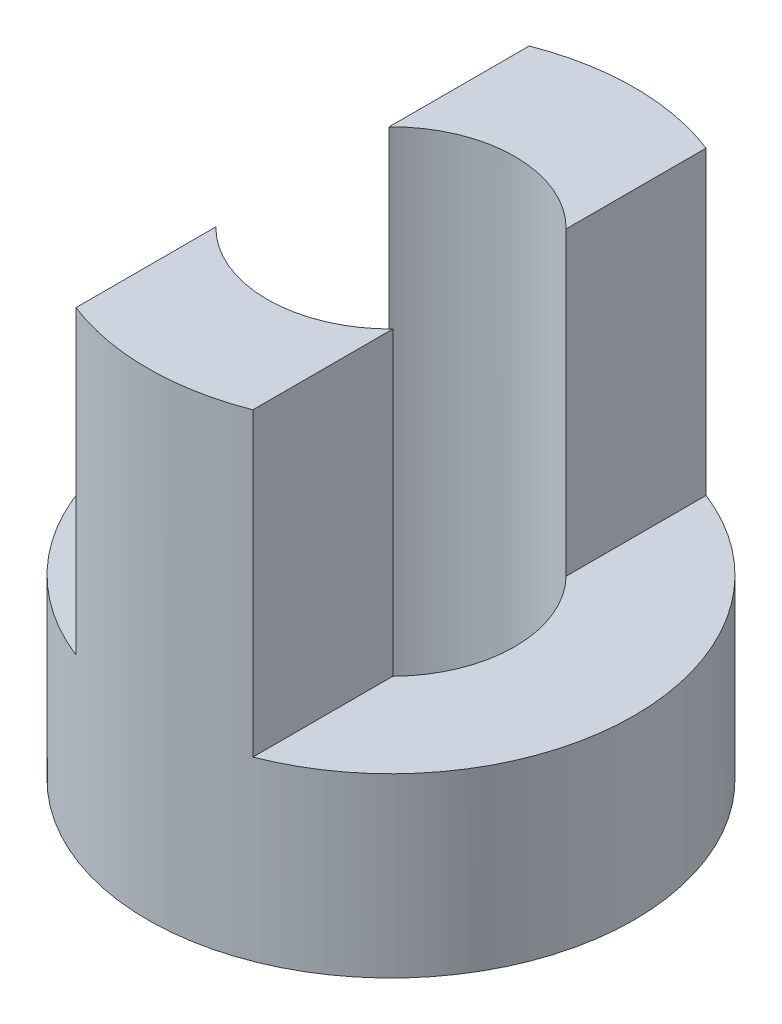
ISO-10303-21;
HEADER;
FILE_DESCRIPTION(('STEP AP214'),'2;1');
FILE_NAME('part.step','',(''),(''),'','','');
FILE_SCHEMA(('AUTOMOTIVE_DESIGN { 1 0 10303 214 1 1 1 1 }'));
ENDSEC;
DATA;
#1=APPLICATION_CONTEXT('core data for automotive mechanical design processes');
#2=APPLICATION_PROTOCOL_DEFINITION('international standard','automotive_design',2000,#1);
#3=PRODUCT_CONTEXT('',#1,'mechanical');
#4=PRODUCT('Part','Part','',(#3));
#5=PRODUCT_RELATED_PRODUCT_CATEGORY('part','',(#4));
#6=PRODUCT_DEFINITION_FORMATION('','',#4);
#7=PRODUCT_DEFINITION_CONTEXT('part definition',#1,'design');
#8=PRODUCT_DEFINITION('design','',#6,#7);
#9=PRODUCT_DEFINITION_SHAPE('','',#8);
#10=(LENGTH_UNIT() NAMED_UNIT(*) SI_UNIT(.MILLI.,.METRE.));
#11=(NAMED_UNIT(*) PLANE_ANGLE_UNIT() SI_UNIT($,.RADIAN.));
#12=(NAMED_UNIT(*) SI_UNIT($,.STERADIAN.) SOLID_ANGLE_UNIT());
#13=UNCERTAINTY_MEASURE_WITH_UNIT(LENGTH_MEASURE(1.E-05),#10,'distance_accuracy_value','');
#14=(GEOMETRIC_REPRESENTATION_CONTEXT(3) GLOBAL_UNCERTAINTY_ASSIGNED_CONTEXT((#13)) GLOBAL_UNIT_ASSIGNED_CONTEXT((#10,
#11,#12)) REPRESENTATION_CONTEXT('',''));
#15=CARTESIAN_POINT('',(0.,0.,0.));
#16=DIRECTION('',(0.,0.,1.));
#17=DIRECTION('',(1.,0.,0.));
#18=AXIS2_PLACEMENT_3D('',#15,#16,#17);
#19=CARTESIAN_POINT('',(0.,77.,0.));
#20=DIRECTION('',(0.,-1.,0.));
#21=DIRECTION('',(1.,0.,0.));
#22=AXIS2_PLACEMENT_3D('',#19,#20,#21);
#23=CYLINDRICAL_SURFACE('',#22,14.);
#24=DIRECTION('',(0.,1.,0.));
#25=VECTOR('',#24,1.);
#26=CARTESIAN_POINT('',(-10.,38.9993507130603,9.79795897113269));
#27=LINE('',#26,#25);
#28=CARTESIAN_POINT('',(-10.,19.9993507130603,9.7979589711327));
#29=VERTEX_POINT('',#28);
#30=CARTESIAN_POINT('',(-10.,53.9993507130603,9.7979589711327));
#31=VERTEX_POINT('',#30);
#32=EDGE_CURVE('E107',#29,#31,#27,.T.);
#33=ORIENTED_EDGE('',*,*,#32,.T.);
#34=CARTESIAN_POINT('',(0.,53.9993507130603,0.));
#35=DIRECTION('',(0.,-1.,0.));
#36=DIRECTION('',(1.,0.,0.));
#37=AXIS2_PLACEMENT_3D('',#34,#35,#36);
#38=CIRCLE('',#37,14.);
#39=CARTESIAN_POINT('',(10.,53.9993507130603,9.7979589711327));
#40=VERTEX_POINT('',#39);
#41=EDGE_CURVE('E108',#31,#40,#38,.F.);
#42=ORIENTED_EDGE('',*,*,#41,.T.);
#43=DIRECTION('',(0.,1.,0.));
#44=VECTOR('',#43,1.);
#45=CARTESIAN_POINT('',(10.,38.9993507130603,9.79795897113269));
#46=LINE('',#45,#44);
#47=CARTESIAN_POINT('',(10.,19.9993507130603,9.7979589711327));
#48=VERTEX_POINT('',#47);
#49=EDGE_CURVE('E110',#40,#48,#46,.F.);
#50=ORIENTED_EDGE('',*,*,#49,.T.);
#51=CARTESIAN_POINT('',(0.,19.9993507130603,0.));
#52=DIRECTION('',(0.,-1.,0.));
#53=DIRECTION('',(1.,0.,0.));
#54=AXIS2_PLACEMENT_3D('',#51,#52,#53);
#55=CIRCLE('',#54,14.);
#56=CARTESIAN_POINT('',(10.,19.9993507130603,-9.7979589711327));
#57=VERTEX_POINT('',#56);
#58=EDGE_CURVE('E135',#48,#57,#55,.F.);
#59=ORIENTED_EDGE('',*,*,#58,.T.);
#60=DIRECTION('',(0.,1.,0.));
#61=VECTOR('',#60,1.);
#62=CARTESIAN_POINT('',(10.,38.9993507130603,-9.79795897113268));
#63=LINE('',#62,#61);
#64=CARTESIAN_POINT('',(10.,53.9993507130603,-9.7979589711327));
#65=VERTEX_POINT('',#64);
#66=EDGE_CURVE('E115',#57,#65,#63,.T.);
#67=ORIENTED_EDGE('',*,*,#66,.T.);
#68=CARTESIAN_POINT('',(0.,53.9993507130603,0.));
#69=DIRECTION('',(0.,-1.,0.));
#70=DIRECTION('',(1.,0.,0.));
#71=AXIS2_PLACEMENT_3D('',#68,#69,#70);
#72=CIRCLE('',#71,14.);
#73=CARTESIAN_POINT('',(-10.,53.9993507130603,-9.7979589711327));
#74=VERTEX_POINT('',#73);
#75=EDGE_CURVE('E93',#65,#74,#72,.F.);
#76=ORIENTED_EDGE('',*,*,#75,.T.);
#77=DIRECTION('',(0.,1.,0.));
#78=VECTOR('',#77,1.);
#79=CARTESIAN_POINT('',(-10.,38.9993507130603,-9.79795897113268));
#80=LINE('',#79,#78);
#81=CARTESIAN_POINT('',(-10.,19.9993507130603,-9.7979589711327));
#82=VERTEX_POINT('',#81);
#83=EDGE_CURVE('E90',#74,#82,#80,.F.);
#84=ORIENTED_EDGE('',*,*,#83,.T.);
#85=CARTESIAN_POINT('',(0.,19.9993507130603,0.));
#86=DIRECTION('',(0.,-1.,0.));
#87=DIRECTION('',(1.,0.,0.));
#88=AXIS2_PLACEMENT_3D('',#85,#86,#87);
#89=CIRCLE('',#88,14.);
#90=EDGE_CURVE('E79',#82,#29,#89,.F.);
#91=ORIENTED_EDGE('',*,*,#90,.T.);
#92=EDGE_LOOP('',(#33,#42,#50,#59,#67,#76,#84,#91));
#93=FACE_BOUND('',#92,.T.);
#94=CARTESIAN_POINT('',(0.,0.,0.));
#95=DIRECTION('',(0.,-1.,0.));
#96=DIRECTION('',(1.,0.,0.));
#97=AXIS2_PLACEMENT_3D('',#94,#95,#96);
#98=CIRCLE('',#97,14.);
#99=CARTESIAN_POINT('',(14.,0.,0.));
#100=VERTEX_POINT('',#99);
#101=EDGE_CURVE('E19',#100,#100,#98,.F.);
#102=ORIENTED_EDGE('',*,*,#101,.F.);
#103=EDGE_LOOP('',(#102));
#104=FACE_BOUND('',#103,.T.);
#105=ADVANCED_FACE('F16',(#93,#104),#23,.F.);
#106=CARTESIAN_POINT('',(27.5,0.,0.));
#107=DIRECTION('',(0.,-1.,0.));
#108=DIRECTION('',(0.,0.,-1.));
#109=AXIS2_PLACEMENT_3D('',#106,#107,#108);
#110=PLANE('',#109);
#111=ORIENTED_EDGE('',*,*,#101,.T.);
#112=EDGE_LOOP('',(#111));
#113=FACE_BOUND('',#112,.T.);
#114=CARTESIAN_POINT('',(0.,0.,0.));
#115=DIRECTION('',(0.,-1.,0.));
#116=DIRECTION('',(1.,0.,0.));
#117=AXIS2_PLACEMENT_3D('',#114,#115,#116);
#118=CIRCLE('',#117,27.5);
#119=CARTESIAN_POINT('',(27.5,0.,0.));
#120=VERTEX_POINT('',#119);
#121=EDGE_CURVE('E130',#120,#120,#118,.F.);
#122=ORIENTED_EDGE('',*,*,#121,.F.);
#123=EDGE_LOOP('',(#122));
#124=FACE_BOUND('',#123,.T.);
#125=ADVANCED_FACE('F229',(#113,#124),#110,.T.);
#126=CARTESIAN_POINT('',(0.,19.9993507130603,0.));
#127=DIRECTION('',(0.,-1.,0.));
#128=DIRECTION('',(0.,0.,-1.));
#129=AXIS2_PLACEMENT_3D('',#126,#127,#128);
#130=PLANE('',#129);
#131=CARTESIAN_POINT('',(0.,19.9993507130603,0.));
#132=DIRECTION('',(0.,-1.,0.));
#133=DIRECTION('',(1.,0.,0.));
#134=AXIS2_PLACEMENT_3D('',#131,#132,#133);
#135=CIRCLE('',#134,27.5);
#136=CARTESIAN_POINT('',(-10.,19.9993507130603,25.617376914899));
#137=VERTEX_POINT('',#136);
#138=CARTESIAN_POINT('',(-10.,19.9993507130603,-25.617376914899));
#139=VERTEX_POINT('',#138);
#140=EDGE_CURVE('E128',#137,#139,#135,.T.);
#141=ORIENTED_EDGE('',*,*,#140,.F.);
#142=DIRECTION('',(0.,0.,-1.));
#143=VECTOR('',#142,1.);
#144=CARTESIAN_POINT('',(-10.,19.9993507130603,10.));
#145=LINE('',#144,#143);
#146=EDGE_CURVE('E86',#137,#29,#145,.T.);
#147=ORIENTED_EDGE('',*,*,#146,.T.);
#148=ORIENTED_EDGE('',*,*,#90,.F.);
#149=DIRECTION('',(0.,0.,-1.));
#150=VECTOR('',#149,1.);
#151=CARTESIAN_POINT('',(-10.,19.9993507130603,10.));
#152=LINE('',#151,#150);
#153=EDGE_CURVE('E83',#82,#139,#152,.T.);
#154=ORIENTED_EDGE('',*,*,#153,.T.);
#155=EDGE_LOOP('',(#141,#147,#148,#154));
#156=FACE_BOUND('',#155,.T.);
#157=ADVANCED_FACE('F81',(#156),#130,.F.);
#158=CARTESIAN_POINT('',(-10.,38.9993507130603,10.));
#159=DIRECTION('',(1.,0.,0.));
#160=DIRECTION('',(0.,0.,-1.));
#161=AXIS2_PLACEMENT_3D('',#158,#159,#160);
#162=PLANE('',#161);
#163=DIRECTION('',(0.,0.,-1.));
#164=VECTOR('',#163,1.);
#165=CARTESIAN_POINT('',(-10.,53.9993507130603,10.));
#166=LINE('',#165,#164);
#167=CARTESIAN_POINT('',(-10.,53.9993507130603,-25.617376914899));
#168=VERTEX_POINT('',#167);
#169=EDGE_CURVE('E96',#74,#168,#166,.T.);
#170=ORIENTED_EDGE('',*,*,#169,.T.);
#171=DIRECTION('',(0.,-1.,0.));
#172=VECTOR('',#171,1.);
#173=CARTESIAN_POINT('',(-10.,77.,-25.617376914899));
#174=LINE('',#173,#172);
#175=EDGE_CURVE('E100',#139,#168,#174,.F.);
#176=ORIENTED_EDGE('',*,*,#175,.F.);
#177=ORIENTED_EDGE('',*,*,#153,.F.);
#178=ORIENTED_EDGE('',*,*,#83,.F.);
#179=EDGE_LOOP('',(#170,#176,#177,#178));
#180=FACE_BOUND('',#179,.T.);
#181=ADVANCED_FACE('F98',(#180),#162,.F.);
#182=CARTESIAN_POINT('',(-5.,53.9993507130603,10.));
#183=DIRECTION('',(0.,-1.,0.));
#184=DIRECTION('',(0.,0.,-1.));
#185=AXIS2_PLACEMENT_3D('',#182,#183,#184);
#186=PLANE('',#185);
#187=DIRECTION('',(0.,0.,1.));
#188=VECTOR('',#187,1.);
#189=CARTESIAN_POINT('',(10.,53.9993507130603,10.));
#190=LINE('',#189,#188);
#191=CARTESIAN_POINT('',(10.,53.9993507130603,-25.617376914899));
#192=VERTEX_POINT('',#191);
#193=EDGE_CURVE('E116',#65,#192,#190,.F.);
#194=ORIENTED_EDGE('',*,*,#193,.T.);
#195=CARTESIAN_POINT('',(0.,53.9993507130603,0.));
#196=DIRECTION('',(0.,-1.,0.));
#197=DIRECTION('',(1.,0.,0.));
#198=AXIS2_PLACEMENT_3D('',#195,#196,#197);
#199=CIRCLE('',#198,27.5);
#200=EDGE_CURVE('E125',#168,#192,#199,.T.);
#201=ORIENTED_EDGE('',*,*,#200,.F.);
#202=ORIENTED_EDGE('',*,*,#169,.F.);
#203=ORIENTED_EDGE('',*,*,#75,.F.);
#204=EDGE_LOOP('',(#194,#201,#202,#203));
#205=FACE_BOUND('',#204,.T.);
#206=ADVANCED_FACE('F166',(#205),#186,.F.);
#207=CARTESIAN_POINT('',(10.,38.9993507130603,10.));
#208=DIRECTION('',(-1.,0.,0.));
#209=DIRECTION('',(0.,0.,1.));
#210=AXIS2_PLACEMENT_3D('',#207,#208,#209);
#211=PLANE('',#210);
#212=ORIENTED_EDGE('',*,*,#193,.F.);
#213=ORIENTED_EDGE('',*,*,#66,.F.);
#214=DIRECTION('',(0.,0.,-1.));
#215=VECTOR('',#214,1.);
#216=CARTESIAN_POINT('',(10.,19.9993507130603,0.));
#217=LINE('',#216,#215);
#218=CARTESIAN_POINT('',(9.99999999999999,19.9993507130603,-25.617376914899));
#219=VERTEX_POINT('',#218);
#220=EDGE_CURVE('E137',#57,#219,#217,.T.);
#221=ORIENTED_EDGE('',*,*,#220,.T.);
#222=DIRECTION('',(0.,-1.,0.));
#223=VECTOR('',#222,1.);
#224=CARTESIAN_POINT('',(9.99999999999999,77.,-25.617376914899));
#225=LINE('',#224,#223);
#226=EDGE_CURVE('E124',#192,#219,#225,.T.);
#227=ORIENTED_EDGE('',*,*,#226,.F.);
#228=EDGE_LOOP('',(#212,#213,#221,#227));
#229=FACE_BOUND('',#228,.T.);
#230=ADVANCED_FACE('F169',(#229),#211,.F.);
#231=CARTESIAN_POINT('',(0.,19.9993507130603,0.));
#232=DIRECTION('',(0.,-1.,0.));
#233=DIRECTION('',(0.,0.,-1.));
#234=AXIS2_PLACEMENT_3D('',#231,#232,#233);
#235=PLANE('',#234);
#236=ORIENTED_EDGE('',*,*,#58,.F.);
#237=DIRECTION('',(0.,0.,1.));
#238=VECTOR('',#237,1.);
#239=CARTESIAN_POINT('',(10.,19.9993507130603,10.));
#240=LINE('',#239,#238);
#241=CARTESIAN_POINT('',(10.,19.9993507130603,25.617376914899));
#242=VERTEX_POINT('',#241);
#243=EDGE_CURVE('E114',#48,#242,#240,.T.);
#244=ORIENTED_EDGE('',*,*,#243,.T.);
#245=CARTESIAN_POINT('',(0.,19.9993507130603,0.));
#246=DIRECTION('',(0.,-1.,0.));
#247=DIRECTION('',(1.,0.,0.));
#248=AXIS2_PLACEMENT_3D('',#245,#246,#247);
#249=CIRCLE('',#248,27.5);
#250=EDGE_CURVE('E121',#219,#242,#249,.T.);
#251=ORIENTED_EDGE('',*,*,#250,.F.);
#252=ORIENTED_EDGE('',*,*,#220,.F.);
#253=EDGE_LOOP('',(#236,#244,#251,#252));
#254=FACE_BOUND('',#253,.T.);
#255=ADVANCED_FACE('F161',(#254),#235,.F.);
#256=CARTESIAN_POINT('',(10.,38.9993507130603,10.));
#257=DIRECTION('',(-1.,0.,0.));
#258=DIRECTION('',(0.,0.,1.));
#259=AXIS2_PLACEMENT_3D('',#256,#257,#258);
#260=PLANE('',#259);
#261=DIRECTION('',(0.,0.,-1.));
#262=VECTOR('',#261,1.);
#263=CARTESIAN_POINT('',(10.,53.9993507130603,10.));
#264=LINE('',#263,#262);
#265=CARTESIAN_POINT('',(10.,53.9993507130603,25.617376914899));
#266=VERTEX_POINT('',#265);
#267=EDGE_CURVE('E113',#40,#266,#264,.F.);
#268=ORIENTED_EDGE('',*,*,#267,.T.);
#269=DIRECTION('',(0.,-1.,0.));
#270=VECTOR('',#269,1.);
#271=CARTESIAN_POINT('',(10.,77.,25.617376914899));
#272=LINE('',#271,#270);
#273=EDGE_CURVE('E120',#242,#266,#272,.F.);
#274=ORIENTED_EDGE('',*,*,#273,.F.);
#275=ORIENTED_EDGE('',*,*,#243,.F.);
#276=ORIENTED_EDGE('',*,*,#49,.F.);
#277=EDGE_LOOP('',(#268,#274,#275,#276));
#278=FACE_BOUND('',#277,.T.);
#279=ADVANCED_FACE('F151',(#278),#260,.F.);
#280=CARTESIAN_POINT('',(-5.,53.9993507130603,10.));
#281=DIRECTION('',(0.,-1.,0.));
#282=DIRECTION('',(0.,0.,-1.));
#283=AXIS2_PLACEMENT_3D('',#280,#281,#282);
#284=PLANE('',#283);
#285=DIRECTION('',(0.,0.,-1.));
#286=VECTOR('',#285,1.);
#287=CARTESIAN_POINT('',(-10.,53.9993507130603,10.));
#288=LINE('',#287,#286);
#289=CARTESIAN_POINT('',(-10.,53.9993507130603,25.617376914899));
#290=VERTEX_POINT('',#289);
#291=EDGE_CURVE('E34',#31,#290,#288,.F.);
#292=ORIENTED_EDGE('',*,*,#291,.T.);
#293=CARTESIAN_POINT('',(0.,53.9993507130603,0.));
#294=DIRECTION('',(0.,-1.,0.));
#295=DIRECTION('',(1.,0.,0.));
#296=AXIS2_PLACEMENT_3D('',#293,#294,#295);
#297=CIRCLE('',#296,27.5);
#298=EDGE_CURVE('E25',#266,#290,#297,.T.);
#299=ORIENTED_EDGE('',*,*,#298,.F.);
#300=ORIENTED_EDGE('',*,*,#267,.F.);
#301=ORIENTED_EDGE('',*,*,#41,.F.);
#302=EDGE_LOOP('',(#292,#299,#300,#301));
#303=FACE_BOUND('',#302,.T.);
#304=ADVANCED_FACE('F153',(#303),#284,.F.);
#305=CARTESIAN_POINT('',(-10.,38.9993507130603,10.));
#306=DIRECTION('',(1.,0.,0.));
#307=DIRECTION('',(0.,0.,-1.));
#308=AXIS2_PLACEMENT_3D('',#305,#306,#307);
#309=PLANE('',#308);
#310=ORIENTED_EDGE('',*,*,#291,.F.);
#311=ORIENTED_EDGE('',*,*,#32,.F.);
#312=ORIENTED_EDGE('',*,*,#146,.F.);
#313=DIRECTION('',(0.,-1.,0.));
#314=VECTOR('',#313,1.);
#315=CARTESIAN_POINT('',(-9.99999999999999,77.,25.617376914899));
#316=LINE('',#315,#314);
#317=EDGE_CURVE('E11',#290,#137,#316,.T.);
#318=ORIENTED_EDGE('',*,*,#317,.F.);
#319=EDGE_LOOP('',(#310,#311,#312,#318));
#320=FACE_BOUND('',#319,.T.);
#321=ADVANCED_FACE('F164',(#320),#309,.F.);
#322=CARTESIAN_POINT('',(0.,77.,0.));
#323=DIRECTION('',(0.,-1.,0.));
#324=DIRECTION('',(1.,0.,0.));
#325=AXIS2_PLACEMENT_3D('',#322,#323,#324);
#326=CYLINDRICAL_SURFACE('',#325,27.5);
#327=ORIENTED_EDGE('',*,*,#298,.T.);
#328=ORIENTED_EDGE('',*,*,#317,.T.);
#329=ORIENTED_EDGE('',*,*,#140,.T.);
#330=ORIENTED_EDGE('',*,*,#175,.T.);
#331=ORIENTED_EDGE('',*,*,#200,.T.);
#332=ORIENTED_EDGE('',*,*,#226,.T.);
#333=ORIENTED_EDGE('',*,*,#250,.T.);
#334=ORIENTED_EDGE('',*,*,#273,.T.);
#335=EDGE_LOOP('',(#327,#328,#329,#330,#331,#332,#333,#334));
#336=FACE_BOUND('',#335,.T.);
#337=ORIENTED_EDGE('',*,*,#121,.T.);
#338=EDGE_LOOP('',(#337));
#339=FACE_BOUND('',#338,.T.);
#340=ADVANCED_FACE('F155',(#336,#339),#326,.T.);
#341=CLOSED_SHELL('',(#105,#125,#157,#181,#206,#230,#255,#279,#304,#321,#340));
#342=MANIFOLD_SOLID_BREP('B1',#341);
#343=ADVANCED_BREP_SHAPE_REPRESENTATION('',(#18,#342),#14);
#344=SHAPE_DEFINITION_REPRESENTATION(#9,#343);
ENDSEC;
END-ISO-10303-21;
